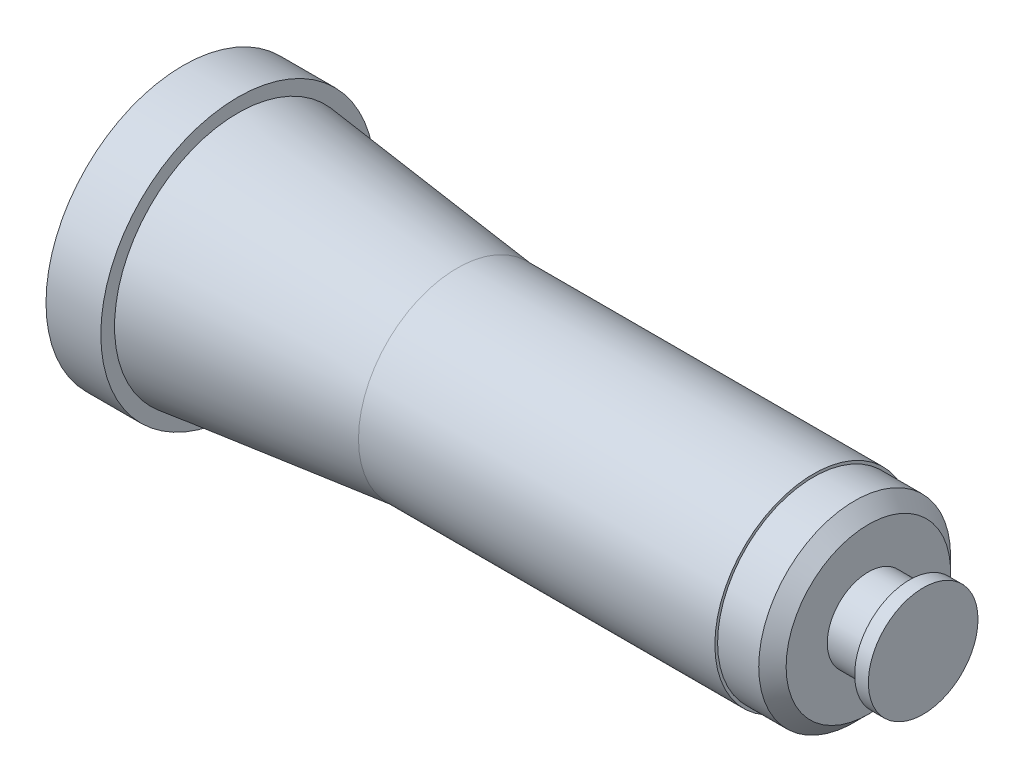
ISO-10303-21;
HEADER;
FILE_DESCRIPTION(('STEP AP214'),'2;1');
FILE_NAME('part.step','',(''),(''),'','','');
FILE_SCHEMA(('AUTOMOTIVE_DESIGN { 1 0 10303 214 1 1 1 1 }'));
ENDSEC;
DATA;
#1=APPLICATION_CONTEXT('core data for automotive mechanical design processes');
#2=APPLICATION_PROTOCOL_DEFINITION('international standard','automotive_design',2000,#1);
#3=PRODUCT_CONTEXT('',#1,'mechanical');
#4=PRODUCT('Part','Part','',(#3));
#5=PRODUCT_RELATED_PRODUCT_CATEGORY('part','',(#4));
#6=PRODUCT_DEFINITION_FORMATION('','',#4);
#7=PRODUCT_DEFINITION_CONTEXT('part definition',#1,'design');
#8=PRODUCT_DEFINITION('design','',#6,#7);
#9=PRODUCT_DEFINITION_SHAPE('','',#8);
#10=(LENGTH_UNIT() NAMED_UNIT(*) SI_UNIT(.MILLI.,.METRE.));
#11=(NAMED_UNIT(*) PLANE_ANGLE_UNIT() SI_UNIT($,.RADIAN.));
#12=(NAMED_UNIT(*) SI_UNIT($,.STERADIAN.) SOLID_ANGLE_UNIT());
#13=UNCERTAINTY_MEASURE_WITH_UNIT(LENGTH_MEASURE(1.E-05),#10,'distance_accuracy_value','');
#14=(GEOMETRIC_REPRESENTATION_CONTEXT(3) GLOBAL_UNCERTAINTY_ASSIGNED_CONTEXT((#13)) GLOBAL_UNIT_ASSIGNED_CONTEXT((#10,
#11,#12)) REPRESENTATION_CONTEXT('',''));
#15=CARTESIAN_POINT('',(0.,0.,0.));
#16=DIRECTION('',(0.,0.,1.));
#17=DIRECTION('',(1.,0.,0.));
#18=AXIS2_PLACEMENT_3D('',#15,#16,#17);
#19=CARTESIAN_POINT('',(-4.,-1.5,0.));
#20=DIRECTION('',(1.,0.,0.));
#21=DIRECTION('',(0.,0.,-1.));
#22=AXIS2_PLACEMENT_3D('',#19,#20,#21);
#23=PLANE('',#22);
#24=CARTESIAN_POINT('',(-4.,0.,0.));
#25=DIRECTION('',(1.,0.,0.));
#26=DIRECTION('',(0.,0.,-1.));
#27=AXIS2_PLACEMENT_3D('',#24,#25,#26);
#28=CIRCLE('',#27,1.5);
#29=CARTESIAN_POINT('',(-4.,0.,-1.5));
#30=VERTEX_POINT('',#29);
#31=EDGE_CURVE('E47',#30,#30,#28,.T.);
#32=ORIENTED_EDGE('',*,*,#31,.F.);
#33=EDGE_LOOP('',(#32));
#34=FACE_BOUND('',#33,.T.);
#35=ADVANCED_FACE('F37',(#34),#23,.F.);
#36=CARTESIAN_POINT('',(0.,0.,0.));
#37=DIRECTION('',(1.,0.,0.));
#38=DIRECTION('',(0.,0.,-1.));
#39=AXIS2_PLACEMENT_3D('',#36,#37,#38);
#40=CYLINDRICAL_SURFACE('',#39,1.5);
#41=CARTESIAN_POINT('',(-13.4019237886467,0.,0.));
#42=DIRECTION('',(1.,0.,0.));
#43=DIRECTION('',(0.,0.,-1.));
#44=AXIS2_PLACEMENT_3D('',#41,#42,#43);
#45=CIRCLE('',#44,1.5);
#46=CARTESIAN_POINT('',(-13.4019237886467,-1.5,0.));
#47=VERTEX_POINT('',#46);
#48=EDGE_CURVE('E51',#47,#47,#45,.T.);
#49=ORIENTED_EDGE('',*,*,#48,.F.);
#50=EDGE_LOOP('',(#49));
#51=FACE_BOUND('',#50,.T.);
#52=ORIENTED_EDGE('',*,*,#31,.T.);
#53=EDGE_LOOP('',(#52));
#54=FACE_BOUND('',#53,.T.);
#55=ADVANCED_FACE('F123',(#51,#54),#40,.F.);
#56=CARTESIAN_POINT('',(-16.,0.,0.));
#57=DIRECTION('',(1.,0.,0.));
#58=DIRECTION('',(0.,-1.,0.));
#59=AXIS2_PLACEMENT_3D('',#56,#57,#58);
#60=SPHERICAL_SURFACE('',#59,3.);
#61=CARTESIAN_POINT('',(-17.7064620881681,0.,0.));
#62=DIRECTION('',(1.,0.,0.));
#63=DIRECTION('',(0.,0.,-1.));
#64=AXIS2_PLACEMENT_3D('',#61,#62,#63);
#65=CIRCLE('',#64,2.46738467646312);
#66=CARTESIAN_POINT('',(-17.7064620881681,-2.46738467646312,0.));
#67=VERTEX_POINT('',#66);
#68=EDGE_CURVE('E56',#67,#67,#65,.T.);
#69=CARTESIAN_POINT('',(-17.7064620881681,-2.46738467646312,0.));
#70=CARTESIAN_POINT('',(-17.6639962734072,-2.49675590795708,0.));
#71=CARTESIAN_POINT('',(-17.6207708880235,-2.52502867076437,0.));
#72=CARTESIAN_POINT('',(-17.5329191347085,-2.57930666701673,0.));
#73=CARTESIAN_POINT('',(-17.4882927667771,-2.6053119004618,0.));
#74=CARTESIAN_POINT('',(-17.3977572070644,-2.65498424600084,0.));
#75=CARTESIAN_POINT('',(-17.351848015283,-2.67865135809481,0.));
#76=CARTESIAN_POINT('',(-17.2588693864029,-2.72358472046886,0.));
#77=CARTESIAN_POINT('',(-17.2117999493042,-2.74485097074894,0.));
#78=CARTESIAN_POINT('',(-17.1166262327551,-2.78492583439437,0.));
#79=CARTESIAN_POINT('',(-17.0685219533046,-2.80373444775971,0.));
#80=CARTESIAN_POINT('',(-16.9714067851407,-2.83884392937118,0.));
#81=CARTESIAN_POINT('',(-16.9223958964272,-2.8551447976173,0.));
#82=CARTESIAN_POINT('',(-16.8235981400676,-2.88519533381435,0.));
#83=CARTESIAN_POINT('',(-16.7738112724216,-2.89894500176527,0.));
#84=CARTESIAN_POINT('',(-16.6735942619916,-2.92385649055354,0.));
#85=CARTESIAN_POINT('',(-16.6231641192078,-2.93501831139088,0.));
#86=CARTESIAN_POINT('',(-16.5217949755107,-2.95472435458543,0.));
#87=CARTESIAN_POINT('',(-16.4708559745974,-2.96326857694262,0.));
#88=CARTESIAN_POINT('',(-16.3686048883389,-2.97771664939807,0.));
#89=CARTESIAN_POINT('',(-16.3172928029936,-2.98362049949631,0.));
#90=CARTESIAN_POINT('',(-16.2144323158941,-2.99277209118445,0.));
#91=CARTESIAN_POINT('',(-16.1628839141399,-2.99601983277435,0.));
#92=CARTESIAN_POINT('',(-16.0596881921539,-2.99985055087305,0.));
#93=CARTESIAN_POINT('',(-16.0080408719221,-3.00043352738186,0.));
#94=CARTESIAN_POINT('',(-15.904784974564,-2.99893316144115,0.));
#95=CARTESIAN_POINT('',(-15.8531763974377,-2.99684981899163,0.));
#96=CARTESIAN_POINT('',(-15.7501355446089,-2.99002236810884,0.));
#97=CARTESIAN_POINT('',(-15.6987032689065,-2.98527825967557,0.));
#98=CARTESIAN_POINT('',(-15.5961521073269,-2.97314192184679,0.));
#99=CARTESIAN_POINT('',(-15.5450332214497,-2.96574969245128,0.));
#100=CARTESIAN_POINT('',(-15.4432450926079,-2.94833681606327,0.));
#101=CARTESIAN_POINT('',(-15.3925758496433,-2.93831616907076,0.));
#102=CARTESIAN_POINT('',(-15.2918220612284,-2.91567316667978,0.));
#103=CARTESIAN_POINT('',(-15.2417375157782,-2.9030508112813,0.));
#104=CARTESIAN_POINT('',(-15.1422866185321,-2.8752380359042,0.));
#105=CARTESIAN_POINT('',(-15.0929202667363,-2.86004761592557,0.));
#106=CARTESIAN_POINT('',(-14.9950373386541,-2.82713920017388,0.));
#107=CARTESIAN_POINT('',(-14.9465207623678,-2.80942120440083,0.));
#108=CARTESIAN_POINT('',(-14.8504667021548,-2.77150486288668,0.));
#109=CARTESIAN_POINT('',(-14.802929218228,-2.75130651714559,0.));
#110=CARTESIAN_POINT('',(-14.7089600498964,-2.7084833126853,0.));
#111=CARTESIAN_POINT('',(-14.6625283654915,-2.68585845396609,0.));
#112=CARTESIAN_POINT('',(-14.5708945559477,-2.63824252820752,0.));
#113=CARTESIAN_POINT('',(-14.5256924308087,-2.61325146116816,0.));
#114=CARTESIAN_POINT('',(-14.4366382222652,-2.56096973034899,0.));
#115=CARTESIAN_POINT('',(-14.3927861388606,-2.53367906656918,0.));
#116=CARTESIAN_POINT('',(-14.3065488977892,-2.47687088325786,0.));
#117=CARTESIAN_POINT('',(-14.2641637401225,-2.44735336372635,0.));
#118=CARTESIAN_POINT('',(-14.1809733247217,-2.38617014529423,0.));
#119=CARTESIAN_POINT('',(-14.1401680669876,-2.35450444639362,0.));
#120=CARTESIAN_POINT('',(-14.0602462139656,-2.28910927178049,0.));
#121=CARTESIAN_POINT('',(-14.0211296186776,-2.25537979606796,0.));
#122=CARTESIAN_POINT('',(-13.9446893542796,-2.18594696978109,0.));
#123=CARTESIAN_POINT('',(-13.9073656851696,-2.15024361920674,0.));
#124=CARTESIAN_POINT('',(-13.8346107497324,-2.07695821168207,0.));
#125=CARTESIAN_POINT('',(-13.799179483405,-2.03937615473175,0.));
#126=CARTESIAN_POINT('',(-13.7303038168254,-1.96243349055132,0.));
#127=CARTESIAN_POINT('',(-13.6968594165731,-1.92307288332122,0.));
#128=CARTESIAN_POINT('',(-13.6320465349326,-1.84267808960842,0.));
#129=CARTESIAN_POINT('',(-13.6006780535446,-1.80164390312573,0.));
#130=CARTESIAN_POINT('',(-13.5401009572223,-1.71801110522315,0.));
#131=CARTESIAN_POINT('',(-13.5108923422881,-1.67541249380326,0.));
#132=CARTESIAN_POINT('',(-13.4547115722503,-1.5887652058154,0.));
#133=CARTESIAN_POINT('',(-13.4277394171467,-1.54471652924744,0.));
#134=CARTESIAN_POINT('',(-13.4019237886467,-1.5,0.));
#135=B_SPLINE_CURVE_WITH_KNOTS('',3,(#69,#70,#71,#72,#73,#74,#75,#76,#77,#78,#79,#80,#81,#82,
#83,#84,#85,#86,#87,#88,#89,#90,#91,#92,#93,#94,#95,#96,#97,#98,#99,#100,#101,#102,#103,#104,
#105,#106,#107,#108,#109,#110,#111,#112,#113,#114,#115,#116,#117,#118,#119,#120,#121,#122,#123,
#124,#125,#126,#127,#128,#129,#130,#131,#132,#133,#134),.UNSPECIFIED.,.F.,.F.,(4,2,2,2,2,2,2,2,
2,2,2,2,2,2,2,2,2,2,2,2,2,2,2,2,2,2,2,2,2,2,2,2,4),(0.,0.154882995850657,0.309765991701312,
0.46464898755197,0.619531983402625,0.77441497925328,0.929297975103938,1.08418097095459,
1.23906396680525,1.39394696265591,1.54882995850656,1.70371295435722,1.85859595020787,
2.01347894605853,2.16836194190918,2.32324493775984,2.4781279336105,2.63301092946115,
2.78789392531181,2.94277692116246,3.09765991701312,3.25254291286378,3.40742590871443,
3.56230890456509,3.71719190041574,3.8720748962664,4.02695789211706,4.18184088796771,
4.33672388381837,4.49160687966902,4.64648987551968,4.80137287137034,4.95625586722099),.UNSPECIFIED.);
#136=EDGE_CURVE('BSEAM128',#67,#47,#135,.T.);
#137=ORIENTED_EDGE('',*,*,#68,.F.);
#138=ORIENTED_EDGE('',*,*,#48,.T.);
#139=ORIENTED_EDGE('',*,*,#136,.T.);
#140=ORIENTED_EDGE('',*,*,#136,.F.);
#141=EDGE_LOOP('',(#137,#139,#138,#140));
#142=FACE_BOUND('',#141,.T.);
#143=ADVANCED_FACE('F128',(#142),#60,.F.);
#144=CARTESIAN_POINT('',(-17.7064620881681,0.,0.));
#145=DIRECTION('',(-1.,0.,0.));
#146=DIRECTION('',(0.,0.,1.));
#147=AXIS2_PLACEMENT_3D('',#144,#145,#146);
#148=CONICAL_SURFACE('',#147,2.46738467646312,0.110657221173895);
#149=CARTESIAN_POINT('',(-27.,0.,0.));
#150=DIRECTION('',(1.,0.,0.));
#151=DIRECTION('',(0.,0.,-1.));
#152=AXIS2_PLACEMENT_3D('',#149,#150,#151);
#153=CIRCLE('',#152,3.5);
#154=CARTESIAN_POINT('',(-27.,0.,-3.5));
#155=VERTEX_POINT('',#154);
#156=EDGE_CURVE('E59',#155,#155,#153,.T.);
#157=ORIENTED_EDGE('',*,*,#156,.F.);
#158=EDGE_LOOP('',(#157));
#159=FACE_BOUND('',#158,.T.);
#160=ORIENTED_EDGE('',*,*,#68,.T.);
#161=EDGE_LOOP('',(#160));
#162=FACE_BOUND('',#161,.T.);
#163=ADVANCED_FACE('F135',(#159,#162),#148,.F.);
#164=CARTESIAN_POINT('',(-27.,-5.,0.));
#165=DIRECTION('',(1.,0.,0.));
#166=DIRECTION('',(0.,0.,-1.));
#167=AXIS2_PLACEMENT_3D('',#164,#165,#166);
#168=PLANE('',#167);
#169=CARTESIAN_POINT('',(-27.,0.,0.));
#170=DIRECTION('',(1.,0.,0.));
#171=DIRECTION('',(0.,0.,-1.));
#172=AXIS2_PLACEMENT_3D('',#169,#170,#171);
#173=CIRCLE('',#172,5.);
#174=CARTESIAN_POINT('',(-27.,0.,-5.));
#175=VERTEX_POINT('',#174);
#176=EDGE_CURVE('E62',#175,#175,#173,.T.);
#177=ORIENTED_EDGE('',*,*,#176,.F.);
#178=EDGE_LOOP('',(#177));
#179=FACE_BOUND('',#178,.T.);
#180=ORIENTED_EDGE('',*,*,#156,.T.);
#181=EDGE_LOOP('',(#180));
#182=FACE_BOUND('',#181,.T.);
#183=ADVANCED_FACE('F142',(#179,#182),#168,.F.);
#184=CARTESIAN_POINT('',(0.,0.,0.));
#185=DIRECTION('',(1.,0.,0.));
#186=DIRECTION('',(0.,0.,-1.));
#187=AXIS2_PLACEMENT_3D('',#184,#185,#186);
#188=CYLINDRICAL_SURFACE('',#187,5.);
#189=CARTESIAN_POINT('',(-25.,0.,0.));
#190=DIRECTION('',(1.,0.,0.));
#191=DIRECTION('',(0.,0.,-1.));
#192=AXIS2_PLACEMENT_3D('',#189,#190,#191);
#193=CIRCLE('',#192,5.);
#194=CARTESIAN_POINT('',(-25.,0.,-5.));
#195=VERTEX_POINT('',#194);
#196=EDGE_CURVE('E65',#195,#195,#193,.T.);
#197=ORIENTED_EDGE('',*,*,#196,.F.);
#198=EDGE_LOOP('',(#197));
#199=FACE_BOUND('',#198,.T.);
#200=ORIENTED_EDGE('',*,*,#176,.T.);
#201=EDGE_LOOP('',(#200));
#202=FACE_BOUND('',#201,.T.);
#203=ADVANCED_FACE('F146',(#199,#202),#188,.T.);
#204=CARTESIAN_POINT('',(-25.,-4.5,0.));
#205=DIRECTION('',(-1.,0.,0.));
#206=DIRECTION('',(0.,0.,1.));
#207=AXIS2_PLACEMENT_3D('',#204,#205,#206);
#208=PLANE('',#207);
#209=CARTESIAN_POINT('',(-25.,0.,0.));
#210=DIRECTION('',(1.,0.,0.));
#211=DIRECTION('',(0.,0.,-1.));
#212=AXIS2_PLACEMENT_3D('',#209,#210,#211);
#213=CIRCLE('',#212,4.5);
#214=CARTESIAN_POINT('',(-25.,0.,-4.5));
#215=VERTEX_POINT('',#214);
#216=EDGE_CURVE('E68',#215,#215,#213,.T.);
#217=ORIENTED_EDGE('',*,*,#216,.F.);
#218=EDGE_LOOP('',(#217));
#219=FACE_BOUND('',#218,.T.);
#220=ORIENTED_EDGE('',*,*,#196,.T.);
#221=EDGE_LOOP('',(#220));
#222=FACE_BOUND('',#221,.T.);
#223=ADVANCED_FACE('F150',(#219,#222),#208,.F.);
#224=CARTESIAN_POINT('',(-25.,0.,0.));
#225=DIRECTION('',(-1.,0.,0.));
#226=DIRECTION('',(0.,0.,1.));
#227=AXIS2_PLACEMENT_3D('',#224,#225,#226);
#228=CONICAL_SURFACE('',#227,4.5,0.112028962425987);
#229=CARTESIAN_POINT('',(-17.,0.,0.));
#230=DIRECTION('',(1.,0.,0.));
#231=DIRECTION('',(0.,0.,-1.));
#232=AXIS2_PLACEMENT_3D('',#229,#230,#231);
#233=CIRCLE('',#232,3.6);
#234=CARTESIAN_POINT('',(-17.,0.,-3.6));
#235=VERTEX_POINT('',#234);
#236=EDGE_CURVE('E71',#235,#235,#233,.T.);
#237=ORIENTED_EDGE('',*,*,#236,.F.);
#238=EDGE_LOOP('',(#237));
#239=FACE_BOUND('',#238,.T.);
#240=ORIENTED_EDGE('',*,*,#216,.T.);
#241=EDGE_LOOP('',(#240));
#242=FACE_BOUND('',#241,.T.);
#243=ADVANCED_FACE('F154',(#239,#242),#228,.T.);
#244=CARTESIAN_POINT('',(0.,0.,0.));
#245=DIRECTION('',(1.,0.,0.));
#246=DIRECTION('',(0.,0.,-1.));
#247=AXIS2_PLACEMENT_3D('',#244,#245,#246);
#248=CYLINDRICAL_SURFACE('',#247,3.6);
#249=CARTESIAN_POINT('',(-4.,0.,0.));
#250=DIRECTION('',(1.,0.,0.));
#251=DIRECTION('',(0.,0.,-1.));
#252=AXIS2_PLACEMENT_3D('',#249,#250,#251);
#253=CIRCLE('',#252,3.6);
#254=CARTESIAN_POINT('',(-4.,0.,-3.6));
#255=VERTEX_POINT('',#254);
#256=EDGE_CURVE('E74',#255,#255,#253,.T.);
#257=ORIENTED_EDGE('',*,*,#256,.F.);
#258=EDGE_LOOP('',(#257));
#259=FACE_BOUND('',#258,.T.);
#260=ORIENTED_EDGE('',*,*,#236,.T.);
#261=EDGE_LOOP('',(#260));
#262=FACE_BOUND('',#261,.T.);
#263=ADVANCED_FACE('F158',(#259,#262),#248,.T.);
#264=CARTESIAN_POINT('',(-4.,-3.50000000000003,0.));
#265=DIRECTION('',(-1.,0.,0.));
#266=DIRECTION('',(0.,0.,1.));
#267=AXIS2_PLACEMENT_3D('',#264,#265,#266);
#268=PLANE('',#267);
#269=CARTESIAN_POINT('',(-4.,0.,0.));
#270=DIRECTION('',(1.,0.,0.));
#271=DIRECTION('',(0.,0.,-1.));
#272=AXIS2_PLACEMENT_3D('',#269,#270,#271);
#273=CIRCLE('',#272,3.50000000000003);
#274=CARTESIAN_POINT('',(-4.,0.,-3.50000000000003));
#275=VERTEX_POINT('',#274);
#276=EDGE_CURVE('E77',#275,#275,#273,.T.);
#277=ORIENTED_EDGE('',*,*,#276,.F.);
#278=EDGE_LOOP('',(#277));
#279=FACE_BOUND('',#278,.T.);
#280=ORIENTED_EDGE('',*,*,#256,.T.);
#281=EDGE_LOOP('',(#280));
#282=FACE_BOUND('',#281,.T.);
#283=ADVANCED_FACE('F120',(#279,#282),#268,.F.);
#284=CARTESIAN_POINT('',(0.,0.,0.));
#285=DIRECTION('',(1.,0.,0.));
#286=DIRECTION('',(0.,0.,-1.));
#287=AXIS2_PLACEMENT_3D('',#284,#285,#286);
#288=CYLINDRICAL_SURFACE('',#287,3.50000000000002);
#289=CARTESIAN_POINT('',(-2.5,0.,0.));
#290=DIRECTION('',(-1.,0.,0.));
#291=DIRECTION('',(0.,0.,1.));
#292=AXIS2_PLACEMENT_3D('',#289,#290,#291);
#293=CIRCLE('',#292,3.50000000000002);
#294=CARTESIAN_POINT('',(-2.5,0.,3.50000000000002));
#295=VERTEX_POINT('',#294);
#296=EDGE_CURVE('E10',#295,#295,#293,.T.);
#297=ORIENTED_EDGE('',*,*,#296,.T.);
#298=EDGE_LOOP('',(#297));
#299=FACE_BOUND('',#298,.T.);
#300=ORIENTED_EDGE('',*,*,#276,.T.);
#301=EDGE_LOOP('',(#300));
#302=FACE_BOUND('',#301,.T.);
#303=ADVANCED_FACE('F115',(#299,#302),#288,.T.);
#304=CARTESIAN_POINT('',(-1.99999999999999,-1.5,0.));
#305=DIRECTION('',(-1.,0.,0.));
#306=DIRECTION('',(0.,0.,1.));
#307=AXIS2_PLACEMENT_3D('',#304,#305,#306);
#308=PLANE('',#307);
#309=CARTESIAN_POINT('',(-1.99999999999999,0.,0.));
#310=DIRECTION('',(-1.,0.,0.));
#311=DIRECTION('',(0.,0.,1.));
#312=AXIS2_PLACEMENT_3D('',#309,#310,#311);
#313=CIRCLE('',#312,3.00000000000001);
#314=CARTESIAN_POINT('',(-1.99999999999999,0.,3.00000000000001));
#315=VERTEX_POINT('',#314);
#316=EDGE_CURVE('E43',#315,#315,#313,.F.);
#317=ORIENTED_EDGE('',*,*,#316,.T.);
#318=EDGE_LOOP('',(#317));
#319=FACE_BOUND('',#318,.T.);
#320=CARTESIAN_POINT('',(-1.99999999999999,0.,0.));
#321=DIRECTION('',(1.,0.,0.));
#322=DIRECTION('',(0.,0.,-1.));
#323=AXIS2_PLACEMENT_3D('',#320,#321,#322);
#324=CIRCLE('',#323,1.5);
#325=CARTESIAN_POINT('',(-1.99999999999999,0.,-1.5));
#326=VERTEX_POINT('',#325);
#327=EDGE_CURVE('E80',#326,#326,#324,.T.);
#328=ORIENTED_EDGE('',*,*,#327,.F.);
#329=EDGE_LOOP('',(#328));
#330=FACE_BOUND('',#329,.T.);
#331=ADVANCED_FACE('F110',(#319,#330),#308,.F.);
#332=CARTESIAN_POINT('',(0.,0.,0.));
#333=DIRECTION('',(1.,0.,0.));
#334=DIRECTION('',(0.,0.,-1.));
#335=AXIS2_PLACEMENT_3D('',#332,#333,#334);
#336=CYLINDRICAL_SURFACE('',#335,1.5);
#337=CARTESIAN_POINT('',(-0.5,0.,0.));
#338=DIRECTION('',(1.,0.,0.));
#339=DIRECTION('',(0.,0.,-1.));
#340=AXIS2_PLACEMENT_3D('',#337,#338,#339);
#341=CIRCLE('',#340,1.5);
#342=CARTESIAN_POINT('',(-0.5,0.,-1.5));
#343=VERTEX_POINT('',#342);
#344=EDGE_CURVE('E83',#343,#343,#341,.T.);
#345=ORIENTED_EDGE('',*,*,#344,.F.);
#346=EDGE_LOOP('',(#345));
#347=FACE_BOUND('',#346,.T.);
#348=ORIENTED_EDGE('',*,*,#327,.T.);
#349=EDGE_LOOP('',(#348));
#350=FACE_BOUND('',#349,.T.);
#351=ADVANCED_FACE('F104',(#347,#350),#336,.T.);
#352=CARTESIAN_POINT('',(-0.5,-2.,0.));
#353=DIRECTION('',(1.,0.,0.));
#354=DIRECTION('',(0.,0.,-1.));
#355=AXIS2_PLACEMENT_3D('',#352,#353,#354);
#356=PLANE('',#355);
#357=CARTESIAN_POINT('',(-0.5,0.,0.));
#358=DIRECTION('',(1.,0.,0.));
#359=DIRECTION('',(0.,0.,-1.));
#360=AXIS2_PLACEMENT_3D('',#357,#358,#359);
#361=CIRCLE('',#360,2.);
#362=CARTESIAN_POINT('',(-0.5,0.,-2.));
#363=VERTEX_POINT('',#362);
#364=EDGE_CURVE('E86',#363,#363,#361,.T.);
#365=ORIENTED_EDGE('',*,*,#364,.F.);
#366=EDGE_LOOP('',(#365));
#367=FACE_BOUND('',#366,.T.);
#368=ORIENTED_EDGE('',*,*,#344,.T.);
#369=EDGE_LOOP('',(#368));
#370=FACE_BOUND('',#369,.T.);
#371=ADVANCED_FACE('F98',(#367,#370),#356,.F.);
#372=CARTESIAN_POINT('',(0.,0.,0.));
#373=DIRECTION('',(1.,0.,0.));
#374=DIRECTION('',(0.,0.,-1.));
#375=AXIS2_PLACEMENT_3D('',#372,#373,#374);
#376=CYLINDRICAL_SURFACE('',#375,2.);
#377=CARTESIAN_POINT('',(0.,0.,0.));
#378=DIRECTION('',(1.,0.,0.));
#379=DIRECTION('',(0.,0.,-1.));
#380=AXIS2_PLACEMENT_3D('',#377,#378,#379);
#381=CIRCLE('',#380,2.);
#382=CARTESIAN_POINT('',(0.,0.,-2.));
#383=VERTEX_POINT('',#382);
#384=EDGE_CURVE('E89',#383,#383,#381,.T.);
#385=ORIENTED_EDGE('',*,*,#384,.F.);
#386=EDGE_LOOP('',(#385));
#387=FACE_BOUND('',#386,.T.);
#388=ORIENTED_EDGE('',*,*,#364,.T.);
#389=EDGE_LOOP('',(#388));
#390=FACE_BOUND('',#389,.T.);
#391=ADVANCED_FACE('F95',(#387,#390),#376,.T.);
#392=CARTESIAN_POINT('',(0.,0.,0.));
#393=DIRECTION('',(-1.,0.,0.));
#394=DIRECTION('',(0.,0.,1.));
#395=AXIS2_PLACEMENT_3D('',#392,#393,#394);
#396=PLANE('',#395);
#397=ORIENTED_EDGE('',*,*,#384,.T.);
#398=EDGE_LOOP('',(#397));
#399=FACE_BOUND('',#398,.T.);
#400=ADVANCED_FACE('F93',(#399),#396,.F.);
#401=CARTESIAN_POINT('',(-1.99999999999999,0.,0.));
#402=DIRECTION('',(-1.,0.,0.));
#403=DIRECTION('',(0.,0.,1.));
#404=AXIS2_PLACEMENT_3D('',#401,#402,#403);
#405=CONICAL_SURFACE('',#404,3.00000000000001,0.785398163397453);
#406=ORIENTED_EDGE('',*,*,#296,.F.);
#407=EDGE_LOOP('',(#406));
#408=FACE_BOUND('',#407,.T.);
#409=ORIENTED_EDGE('',*,*,#316,.F.);
#410=EDGE_LOOP('',(#409));
#411=FACE_BOUND('',#410,.T.);
#412=ADVANCED_FACE('F221',(#408,#411),#405,.T.);
#413=CLOSED_SHELL('',(#35,#55,#143,#163,#183,#203,#223,#243,#263,#283,#303,#331,#351,#371,#391,
#400,#412));
#414=MANIFOLD_SOLID_BREP('B2',#413);
#415=ADVANCED_BREP_SHAPE_REPRESENTATION('',(#18,#414),#14);
#416=SHAPE_DEFINITION_REPRESENTATION(#9,#415);
ENDSEC;
END-ISO-10303-21;
